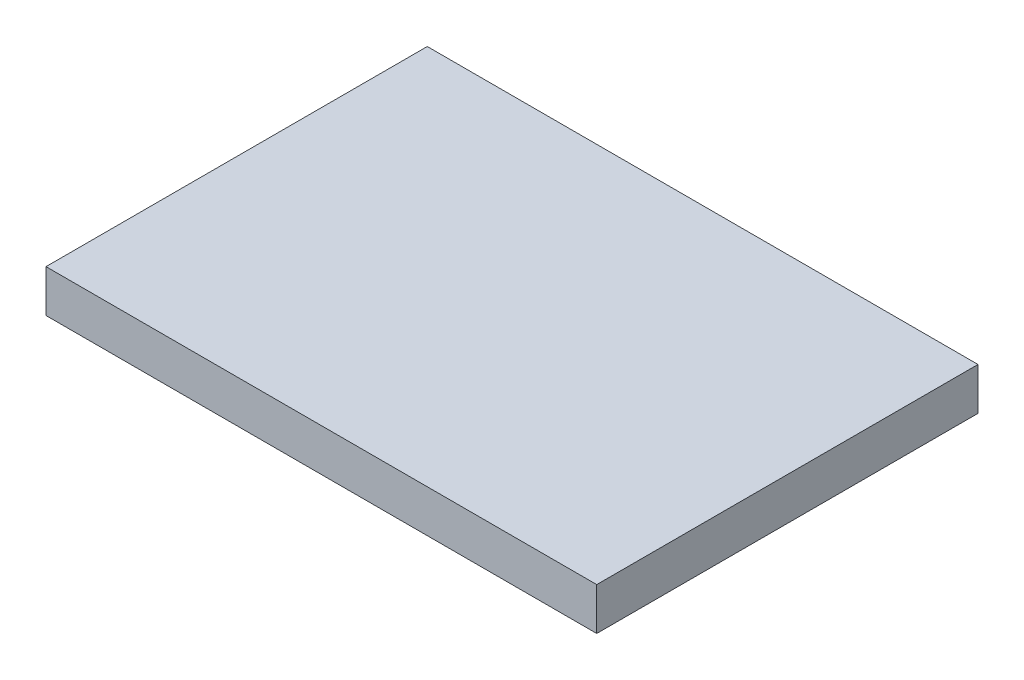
from build123d import *

# Parameters (mm, degrees)
ESQUISSE1_W        = 325
ESQUISSE1_H        = 25
BOSS_EXTRU_1_DEPTH = 225


with BuildPart() as part:
    # Esquisse1 → Boss.-Extru.1 (new body)
    with BuildSketch(Plane.XY):
        with Locations((45.971816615, 57.489217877)):
            Rectangle(ESQUISSE1_W, ESQUISSE1_H)
    extrude(amount=BOSS_EXTRU_1_DEPTH)


solid = part.part
